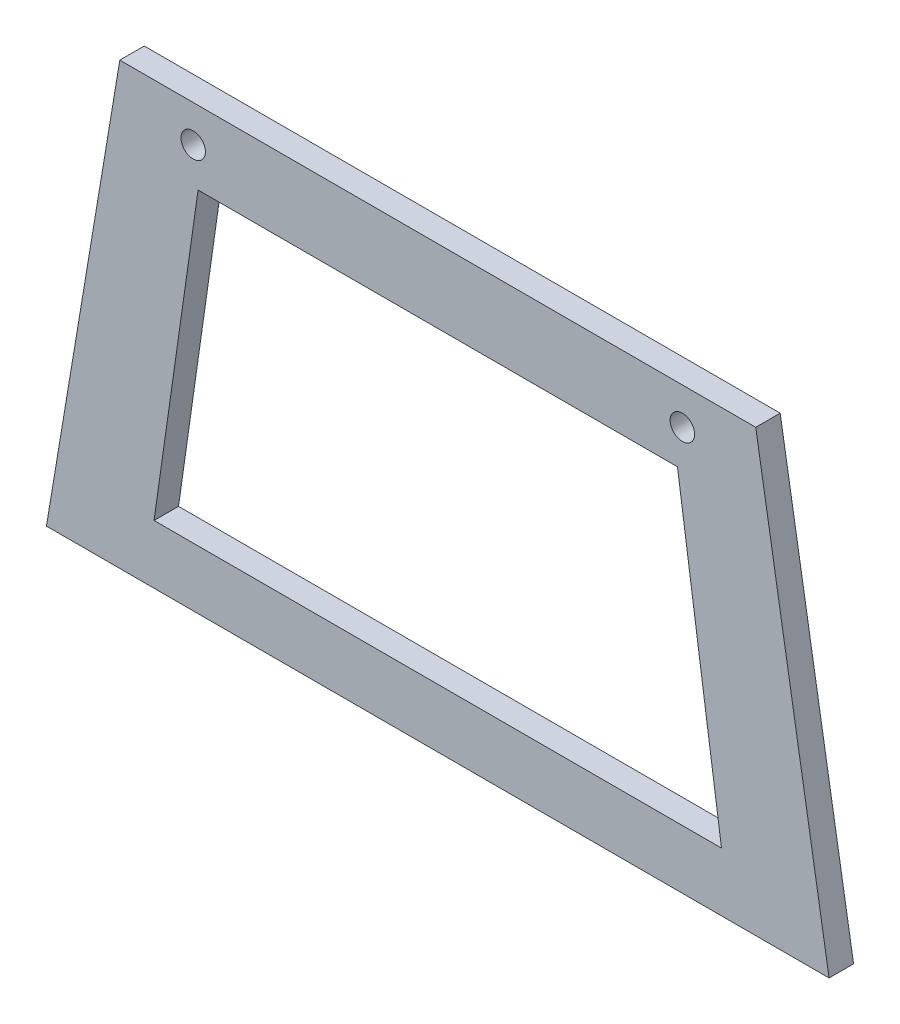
from build123d import *

# Parameters (mm, degrees)
BOSS_EXTRUDE1_DEPTH = 3.175
SKETCH2_R           = 3.175
CUT_EXTRUDE1_DEPTH  = 12.7


with BuildPart() as part:
    # Sketch1 → Boss-Extrude1 (new, symmetric)
    with BuildSketch(Plane.XY):
        Polygon((-101.6, 0), (101.6, 0), (82.55, 114.3), (-82.55, 114.3), align=None)
    extrude(amount=BOSS_EXTRUDE1_DEPTH, both=True)

    # Sketch2 → Cut-Extrude1 (cut, symmetric)
    with BuildSketch(Plane.XY):
        with Locations((-63.5, 104.775)):
            Circle(SKETCH2_R)
        with Locations((63.5, 104.775)):
            Circle(SKETCH2_R)
        Polygon((-73.66, 15.24), (73.66, 15.24), (62.23, 95.25), (-62.23, 95.25), align=None)
    extrude(amount=CUT_EXTRUDE1_DEPTH, both=True, mode=Mode.SUBTRACT)


solid = part.part
